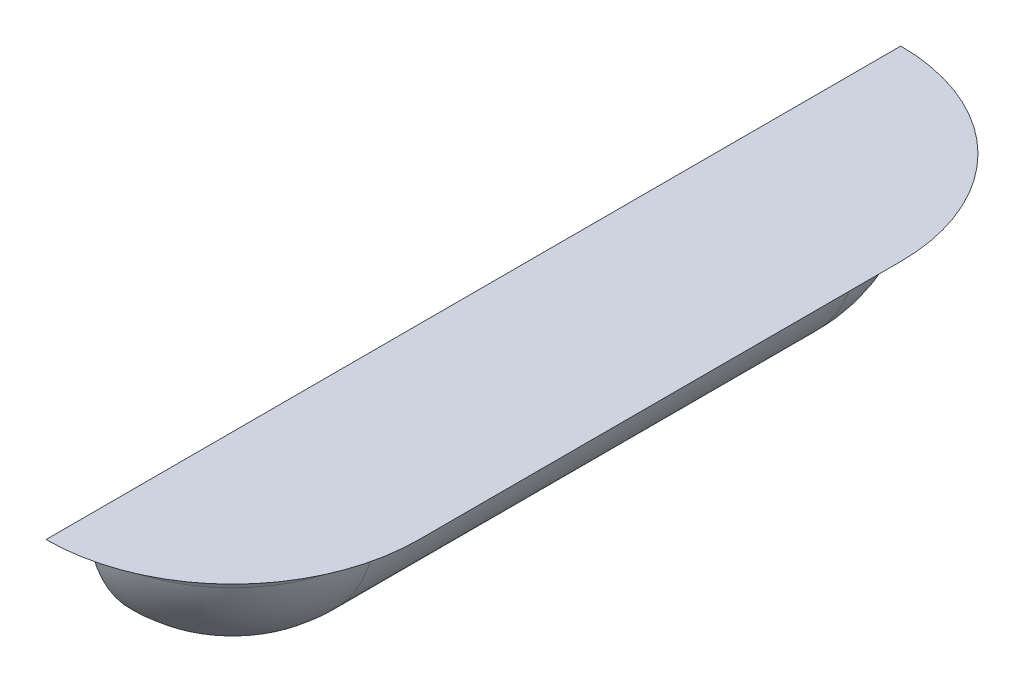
from build123d import *

# Parameters (mm, degrees)
SKETCH1_W           = 30
SKETCH1_H           = 3.464243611
BASE_EXTRUDE_DEPTH  = 25
BOSS_EXTRUDE1_DEPTH = 10
BOSS_REVOLVE2_ANGLE = 90
BOSS_REVOLVE3_ANGLE = 90
FILLET1_R           = 2
SKETCH8_W           = 50
SKETCH8_H           = 3.464243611
CUT_EXTRUDE4_DEPTH  = 40.509492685


with BuildPart() as part:
    # Sketch1 → Base-Extrude (new, symmetric)
    with BuildSketch(Plane.XY):
        with Locations((0, 1.732121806)):
            Rectangle(SKETCH1_W, SKETCH1_H)
    extrude(amount=BASE_EXTRUDE_DEPTH, both=True)

    # Louver Body → Boss-Extrude1 (add, symmetric)
    with BuildSketch(Plane.XY):
        with BuildLine():
            Line((-3, 0), (-3, -6))
            ThreePointArc((-3, -6), (1.242640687, -4.242640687), (3, 0))
            Line((3, 0), (-3, 0))
        make_face()
    extrude(amount=BOSS_EXTRUDE1_DEPTH, both=True)

    # Sketch12 → Boss-Revolve2 (revolve)
    with BuildSketch(Plane.XY.offset(10)):
        with BuildLine():
            Line((3, 0), (-3, 0))
            Line((-3, 0), (-3, -6))
            ThreePointArc((-3, -6), (1.242640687, -4.242640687), (3, 0))
        make_face()
    revolve(axis=Axis((-3, 0, 10), (0, -1, 0)), revolution_arc=BOSS_REVOLVE2_ANGLE)

    # Sketch13 → Boss-Revolve3 (revolve)
    with BuildSketch(Plane(origin=(0, 0, -10), x_dir=(-1, 0, 0), z_dir=(0, 0, -1))):
        with BuildLine():
            Line((3, 0), (-3, 0))
            ThreePointArc((-3, 0), (-1.242640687, -4.242640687), (3, -6))
            Line((3, -6), (3, 0))
        make_face()
    revolve(axis=Axis((-3, -6, -10), (0, 1, 0)), revolution_arc=BOSS_REVOLVE3_ANGLE)

    # Fillet1
    fillet1_edges = [part.edges().sort_by_distance(p)[0] for p in [
        (3, 0, 0),
        (1.242640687, 0, 14.242640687),
        (1.242640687, 0, -14.242640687),
    ]]
    fillet(fillet1_edges, radius=FILLET1_R)

    # Sketch8 → Cut-Extrude4 (cut, through all)
    with BuildSketch(Plane.ZY.offset(15)):
        with Locations((0, 1.732121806)):
            Rectangle(SKETCH8_W, SKETCH8_H)
    extrude(amount=-CUT_EXTRUDE4_DEPTH, mode=Mode.SUBTRACT)


solid = part.part
